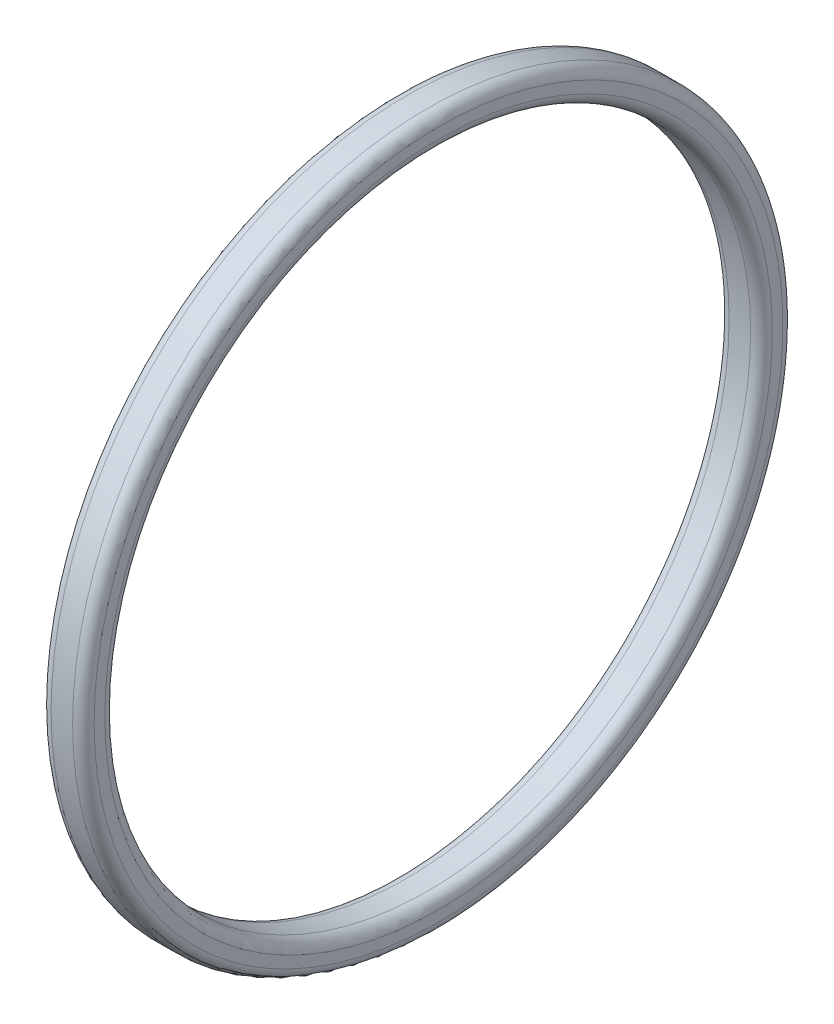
ISO-10303-21;
HEADER;
FILE_DESCRIPTION(('STEP AP214'),'2;1');
FILE_NAME('part.step','',(''),(''),'','','');
FILE_SCHEMA(('AUTOMOTIVE_DESIGN { 1 0 10303 214 1 1 1 1 }'));
ENDSEC;
DATA;
#1=APPLICATION_CONTEXT('core data for automotive mechanical design processes');
#2=APPLICATION_PROTOCOL_DEFINITION('international standard','automotive_design',2000,#1);
#3=PRODUCT_CONTEXT('',#1,'mechanical');
#4=PRODUCT('Part','Part','',(#3));
#5=PRODUCT_RELATED_PRODUCT_CATEGORY('part','',(#4));
#6=PRODUCT_DEFINITION_FORMATION('','',#4);
#7=PRODUCT_DEFINITION_CONTEXT('part definition',#1,'design');
#8=PRODUCT_DEFINITION('design','',#6,#7);
#9=PRODUCT_DEFINITION_SHAPE('','',#8);
#10=(LENGTH_UNIT() NAMED_UNIT(*) SI_UNIT(.MILLI.,.METRE.));
#11=(NAMED_UNIT(*) PLANE_ANGLE_UNIT() SI_UNIT($,.RADIAN.));
#12=(NAMED_UNIT(*) SI_UNIT($,.STERADIAN.) SOLID_ANGLE_UNIT());
#13=UNCERTAINTY_MEASURE_WITH_UNIT(LENGTH_MEASURE(1.E-05),#10,'distance_accuracy_value','');
#14=(GEOMETRIC_REPRESENTATION_CONTEXT(3) GLOBAL_UNCERTAINTY_ASSIGNED_CONTEXT((#13)) GLOBAL_UNIT_ASSIGNED_CONTEXT((#10,
#11,#12)) REPRESENTATION_CONTEXT('',''));
#15=CARTESIAN_POINT('',(0.,0.,0.));
#16=DIRECTION('',(0.,0.,1.));
#17=DIRECTION('',(1.,0.,0.));
#18=AXIS2_PLACEMENT_3D('',#15,#16,#17);
#19=CARTESIAN_POINT('',(30.5,0.,0.));
#20=DIRECTION('',(-1.,0.,0.));
#21=DIRECTION('',(0.,0.,1.));
#22=AXIS2_PLACEMENT_3D('',#19,#20,#21);
#23=TOROIDAL_SURFACE('',#22,16.,0.5);
#24=CARTESIAN_POINT('',(30.5,0.,0.));
#25=DIRECTION('',(-1.,0.,0.));
#26=DIRECTION('',(0.,0.,1.));
#27=AXIS2_PLACEMENT_3D('',#24,#25,#26);
#28=CIRCLE('',#27,16.5);
#29=CARTESIAN_POINT('',(30.5,0.,16.5));
#30=VERTEX_POINT('',#29);
#31=EDGE_CURVE('E10',#30,#30,#28,.T.);
#32=ORIENTED_EDGE('',*,*,#31,.F.);
#33=EDGE_LOOP('',(#32));
#34=FACE_BOUND('',#33,.T.);
#35=CARTESIAN_POINT('',(31.,0.,0.));
#36=DIRECTION('',(-1.,0.,0.));
#37=DIRECTION('',(0.,0.,1.));
#38=AXIS2_PLACEMENT_3D('',#35,#36,#37);
#39=CIRCLE('',#38,16.);
#40=CARTESIAN_POINT('',(31.,0.,16.));
#41=VERTEX_POINT('',#40);
#42=EDGE_CURVE('E50',#41,#41,#39,.T.);
#43=ORIENTED_EDGE('',*,*,#42,.T.);
#44=EDGE_LOOP('',(#43));
#45=FACE_BOUND('',#44,.T.);
#46=ADVANCED_FACE('F22',(#34,#45),#23,.T.);
#47=CARTESIAN_POINT('',(0.,0.,0.));
#48=DIRECTION('',(-1.,0.,0.));
#49=DIRECTION('',(0.,0.,1.));
#50=AXIS2_PLACEMENT_3D('',#47,#48,#49);
#51=CYLINDRICAL_SURFACE('',#50,16.5);
#52=CARTESIAN_POINT('',(29.5,0.,0.));
#53=DIRECTION('',(-1.,0.,0.));
#54=DIRECTION('',(0.,0.,1.));
#55=AXIS2_PLACEMENT_3D('',#52,#53,#54);
#56=CIRCLE('',#55,16.5);
#57=CARTESIAN_POINT('',(29.5,0.,16.5));
#58=VERTEX_POINT('',#57);
#59=EDGE_CURVE('E28',#58,#58,#56,.T.);
#60=ORIENTED_EDGE('',*,*,#59,.F.);
#61=EDGE_LOOP('',(#60));
#62=FACE_BOUND('',#61,.T.);
#63=ORIENTED_EDGE('',*,*,#31,.T.);
#64=EDGE_LOOP('',(#63));
#65=FACE_BOUND('',#64,.T.);
#66=ADVANCED_FACE('F87',(#62,#65),#51,.T.);
#67=CARTESIAN_POINT('',(29.5,0.,0.));
#68=DIRECTION('',(-1.,0.,0.));
#69=DIRECTION('',(0.,0.,1.));
#70=AXIS2_PLACEMENT_3D('',#67,#68,#69);
#71=TOROIDAL_SURFACE('',#70,16.,0.5);
#72=CARTESIAN_POINT('',(29.,0.,0.));
#73=DIRECTION('',(-1.,0.,0.));
#74=DIRECTION('',(0.,0.,1.));
#75=AXIS2_PLACEMENT_3D('',#72,#73,#74);
#76=CIRCLE('',#75,16.);
#77=CARTESIAN_POINT('',(29.,0.,16.));
#78=VERTEX_POINT('',#77);
#79=EDGE_CURVE('E32',#78,#78,#76,.T.);
#80=ORIENTED_EDGE('',*,*,#79,.F.);
#81=EDGE_LOOP('',(#80));
#82=FACE_BOUND('',#81,.T.);
#83=ORIENTED_EDGE('',*,*,#59,.T.);
#84=EDGE_LOOP('',(#83));
#85=FACE_BOUND('',#84,.T.);
#86=ADVANCED_FACE('F82',(#82,#85),#71,.T.);
#87=CARTESIAN_POINT('',(29.,16.,0.));
#88=DIRECTION('',(1.,0.,0.));
#89=DIRECTION('',(0.,0.,-1.));
#90=AXIS2_PLACEMENT_3D('',#87,#88,#89);
#91=PLANE('',#90);
#92=CARTESIAN_POINT('',(29.,0.,0.));
#93=DIRECTION('',(-1.,0.,0.));
#94=DIRECTION('',(0.,0.,1.));
#95=AXIS2_PLACEMENT_3D('',#92,#93,#94);
#96=CIRCLE('',#95,15.5);
#97=CARTESIAN_POINT('',(29.,0.,15.5));
#98=VERTEX_POINT('',#97);
#99=EDGE_CURVE('E36',#98,#98,#96,.T.);
#100=ORIENTED_EDGE('',*,*,#99,.F.);
#101=EDGE_LOOP('',(#100));
#102=FACE_BOUND('',#101,.T.);
#103=ORIENTED_EDGE('',*,*,#79,.T.);
#104=EDGE_LOOP('',(#103));
#105=FACE_BOUND('',#104,.T.);
#106=ADVANCED_FACE('F76',(#102,#105),#91,.F.);
#107=CARTESIAN_POINT('',(29.5,0.,0.));
#108=DIRECTION('',(-1.,0.,0.));
#109=DIRECTION('',(0.,0.,1.));
#110=AXIS2_PLACEMENT_3D('',#107,#108,#109);
#111=TOROIDAL_SURFACE('',#110,15.5,0.5);
#112=CARTESIAN_POINT('',(29.5,0.,0.));
#113=DIRECTION('',(-1.,0.,0.));
#114=DIRECTION('',(0.,0.,1.));
#115=AXIS2_PLACEMENT_3D('',#112,#113,#114);
#116=CIRCLE('',#115,15.);
#117=CARTESIAN_POINT('',(29.5,0.,15.));
#118=VERTEX_POINT('',#117);
#119=EDGE_CURVE('E41',#118,#118,#116,.T.);
#120=ORIENTED_EDGE('',*,*,#119,.F.);
#121=EDGE_LOOP('',(#120));
#122=FACE_BOUND('',#121,.T.);
#123=ORIENTED_EDGE('',*,*,#99,.T.);
#124=EDGE_LOOP('',(#123));
#125=FACE_BOUND('',#124,.T.);
#126=ADVANCED_FACE('F70',(#122,#125),#111,.T.);
#127=CARTESIAN_POINT('',(0.,0.,0.));
#128=DIRECTION('',(-1.,0.,0.));
#129=DIRECTION('',(0.,0.,1.));
#130=AXIS2_PLACEMENT_3D('',#127,#128,#129);
#131=CYLINDRICAL_SURFACE('',#130,15.);
#132=CARTESIAN_POINT('',(30.5,0.,0.));
#133=DIRECTION('',(-1.,0.,0.));
#134=DIRECTION('',(0.,0.,1.));
#135=AXIS2_PLACEMENT_3D('',#132,#133,#134);
#136=CIRCLE('',#135,15.);
#137=CARTESIAN_POINT('',(30.5,0.,15.));
#138=VERTEX_POINT('',#137);
#139=EDGE_CURVE('E44',#138,#138,#136,.T.);
#140=ORIENTED_EDGE('',*,*,#139,.F.);
#141=EDGE_LOOP('',(#140));
#142=FACE_BOUND('',#141,.T.);
#143=ORIENTED_EDGE('',*,*,#119,.T.);
#144=EDGE_LOOP('',(#143));
#145=FACE_BOUND('',#144,.T.);
#146=ADVANCED_FACE('F64',(#142,#145),#131,.F.);
#147=CARTESIAN_POINT('',(30.5,0.,0.));
#148=DIRECTION('',(-1.,0.,0.));
#149=DIRECTION('',(0.,0.,1.));
#150=AXIS2_PLACEMENT_3D('',#147,#148,#149);
#151=TOROIDAL_SURFACE('',#150,15.5,0.5);
#152=CARTESIAN_POINT('',(31.,0.,0.));
#153=DIRECTION('',(-1.,0.,0.));
#154=DIRECTION('',(0.,0.,1.));
#155=AXIS2_PLACEMENT_3D('',#152,#153,#154);
#156=CIRCLE('',#155,15.5);
#157=CARTESIAN_POINT('',(31.,0.,15.5));
#158=VERTEX_POINT('',#157);
#159=EDGE_CURVE('E47',#158,#158,#156,.T.);
#160=ORIENTED_EDGE('',*,*,#159,.F.);
#161=EDGE_LOOP('',(#160));
#162=FACE_BOUND('',#161,.T.);
#163=ORIENTED_EDGE('',*,*,#139,.T.);
#164=EDGE_LOOP('',(#163));
#165=FACE_BOUND('',#164,.T.);
#166=ADVANCED_FACE('F58',(#162,#165),#151,.T.);
#167=CARTESIAN_POINT('',(31.,16.,0.));
#168=DIRECTION('',(-1.,0.,0.));
#169=DIRECTION('',(0.,0.,1.));
#170=AXIS2_PLACEMENT_3D('',#167,#168,#169);
#171=PLANE('',#170);
#172=ORIENTED_EDGE('',*,*,#42,.F.);
#173=EDGE_LOOP('',(#172));
#174=FACE_BOUND('',#173,.T.);
#175=ORIENTED_EDGE('',*,*,#159,.T.);
#176=EDGE_LOOP('',(#175));
#177=FACE_BOUND('',#176,.T.);
#178=ADVANCED_FACE('F55',(#174,#177),#171,.F.);
#179=CLOSED_SHELL('',(#46,#66,#86,#106,#126,#146,#166,#178));
#180=MANIFOLD_SOLID_BREP('B2',#179);
#181=ADVANCED_BREP_SHAPE_REPRESENTATION('',(#18,#180),#14);
#182=SHAPE_DEFINITION_REPRESENTATION(#9,#181);
ENDSEC;
END-ISO-10303-21;
